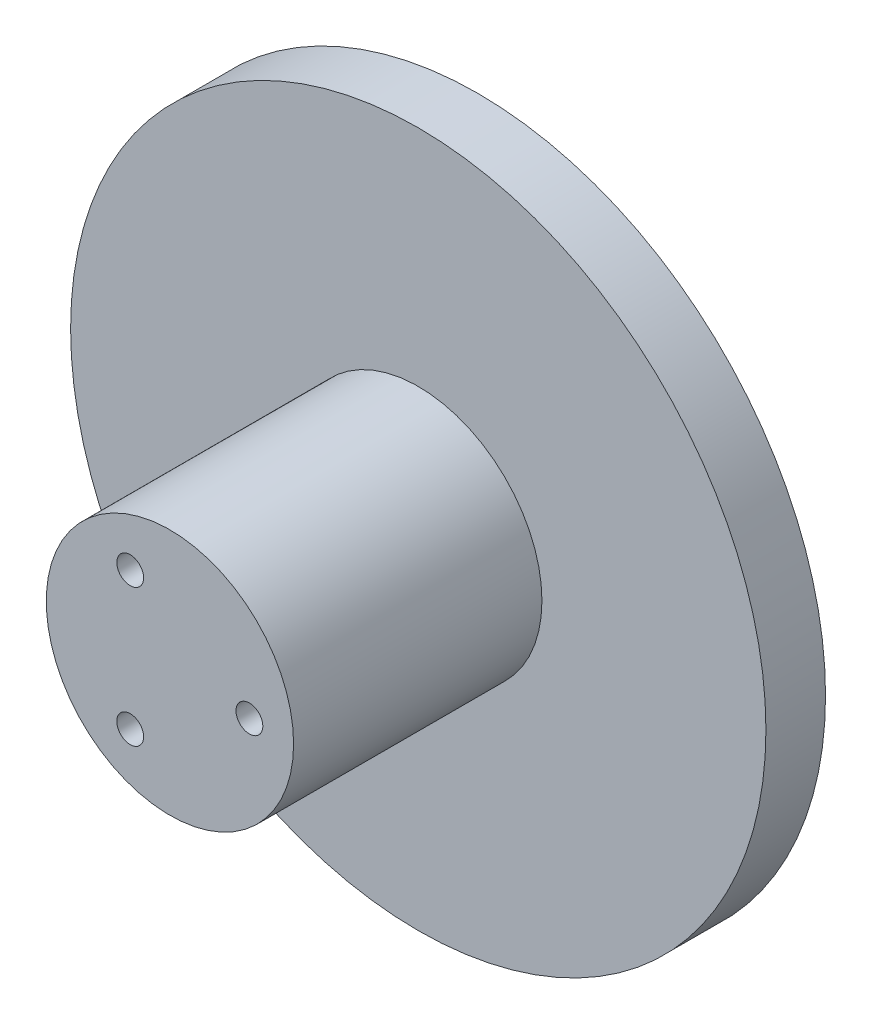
ISO-10303-21;
HEADER;
FILE_DESCRIPTION(('STEP AP214'),'2;1');
FILE_NAME('part.step','',(''),(''),'','','');
FILE_SCHEMA(('AUTOMOTIVE_DESIGN { 1 0 10303 214 1 1 1 1 }'));
ENDSEC;
DATA;
#1=APPLICATION_CONTEXT('core data for automotive mechanical design processes');
#2=APPLICATION_PROTOCOL_DEFINITION('international standard','automotive_design',2000,#1);
#3=PRODUCT_CONTEXT('',#1,'mechanical');
#4=PRODUCT('Part','Part','',(#3));
#5=PRODUCT_RELATED_PRODUCT_CATEGORY('part','',(#4));
#6=PRODUCT_DEFINITION_FORMATION('','',#4);
#7=PRODUCT_DEFINITION_CONTEXT('part definition',#1,'design');
#8=PRODUCT_DEFINITION('design','',#6,#7);
#9=PRODUCT_DEFINITION_SHAPE('','',#8);
#10=(LENGTH_UNIT() NAMED_UNIT(*) SI_UNIT(.MILLI.,.METRE.));
#11=(NAMED_UNIT(*) PLANE_ANGLE_UNIT() SI_UNIT($,.RADIAN.));
#12=(NAMED_UNIT(*) SI_UNIT($,.STERADIAN.) SOLID_ANGLE_UNIT());
#13=UNCERTAINTY_MEASURE_WITH_UNIT(LENGTH_MEASURE(1.E-05),#10,'distance_accuracy_value','');
#14=(GEOMETRIC_REPRESENTATION_CONTEXT(3) GLOBAL_UNCERTAINTY_ASSIGNED_CONTEXT((#13)) GLOBAL_UNIT_ASSIGNED_CONTEXT((#10,
#11,#12)) REPRESENTATION_CONTEXT('',''));
#15=CARTESIAN_POINT('',(0.,0.,0.));
#16=DIRECTION('',(0.,0.,1.));
#17=DIRECTION('',(1.,0.,0.));
#18=AXIS2_PLACEMENT_3D('',#15,#16,#17);
#19=CARTESIAN_POINT('',(8.,0.,23.));
#20=DIRECTION('',(0.,0.,1.));
#21=DIRECTION('',(1.,0.,0.));
#22=AXIS2_PLACEMENT_3D('',#19,#20,#21);
#23=PLANE('',#22);
#24=CARTESIAN_POINT('',(8.,0.,23.));
#25=DIRECTION('',(0.,0.,1.));
#26=DIRECTION('',(1.,0.,0.));
#27=AXIS2_PLACEMENT_3D('',#24,#25,#26);
#28=CIRCLE('',#27,1.35);
#29=CARTESIAN_POINT('',(9.35,0.,23.));
#30=VERTEX_POINT('',#29);
#31=EDGE_CURVE('E9',#30,#30,#28,.T.);
#32=ORIENTED_EDGE('',*,*,#31,.T.);
#33=EDGE_LOOP('',(#32));
#34=FACE_BOUND('',#33,.T.);
#35=ADVANCED_FACE('F14',(#34),#23,.T.);
#36=CARTESIAN_POINT('',(8.,0.,23.));
#37=DIRECTION('',(0.,0.,1.));
#38=DIRECTION('',(1.,0.,0.));
#39=AXIS2_PLACEMENT_3D('',#36,#37,#38);
#40=PLANE('',#39);
#41=CARTESIAN_POINT('',(-4.,6.928203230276,23.));
#42=DIRECTION('',(0.,0.,1.));
#43=DIRECTION('',(1.,0.,0.));
#44=AXIS2_PLACEMENT_3D('',#41,#42,#43);
#45=CIRCLE('',#44,1.35);
#46=CARTESIAN_POINT('',(-2.65,6.928203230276,23.));
#47=VERTEX_POINT('',#46);
#48=EDGE_CURVE('E21',#47,#47,#45,.T.);
#49=ORIENTED_EDGE('',*,*,#48,.T.);
#50=EDGE_LOOP('',(#49));
#51=FACE_BOUND('',#50,.T.);
#52=ADVANCED_FACE('F128',(#51),#40,.T.);
#53=CARTESIAN_POINT('',(8.,0.,23.));
#54=DIRECTION('',(0.,0.,1.));
#55=DIRECTION('',(1.,0.,0.));
#56=AXIS2_PLACEMENT_3D('',#53,#54,#55);
#57=PLANE('',#56);
#58=CARTESIAN_POINT('',(-4.,-6.928203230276,23.));
#59=DIRECTION('',(0.,0.,1.));
#60=DIRECTION('',(1.,0.,0.));
#61=AXIS2_PLACEMENT_3D('',#58,#59,#60);
#62=CIRCLE('',#61,1.35);
#63=CARTESIAN_POINT('',(-2.65,-6.928203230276,23.));
#64=VERTEX_POINT('',#63);
#65=EDGE_CURVE('E26',#64,#64,#62,.T.);
#66=ORIENTED_EDGE('',*,*,#65,.T.);
#67=EDGE_LOOP('',(#66));
#68=FACE_BOUND('',#67,.T.);
#69=ADVANCED_FACE('F135',(#68),#57,.T.);
#70=CARTESIAN_POINT('',(8.,0.,23.));
#71=DIRECTION('',(0.,0.,-1.));
#72=DIRECTION('',(1.,0.,0.));
#73=AXIS2_PLACEMENT_3D('',#70,#71,#72);
#74=CYLINDRICAL_SURFACE('',#73,1.35);
#75=CARTESIAN_POINT('',(8.,0.,31.));
#76=DIRECTION('',(0.,0.,1.));
#77=DIRECTION('',(1.,0.,0.));
#78=AXIS2_PLACEMENT_3D('',#75,#76,#77);
#79=CIRCLE('',#78,1.35);
#80=CARTESIAN_POINT('',(9.35,0.,31.));
#81=VERTEX_POINT('',#80);
#82=EDGE_CURVE('E34',#81,#81,#79,.T.);
#83=ORIENTED_EDGE('',*,*,#82,.T.);
#84=EDGE_LOOP('',(#83));
#85=FACE_BOUND('',#84,.T.);
#86=ORIENTED_EDGE('',*,*,#31,.F.);
#87=EDGE_LOOP('',(#86));
#88=FACE_BOUND('',#87,.T.);
#89=ADVANCED_FACE('F137',(#85,#88),#74,.F.);
#90=CARTESIAN_POINT('',(-4.,6.928203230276,23.));
#91=DIRECTION('',(0.,0.,-1.));
#92=DIRECTION('',(1.,0.,0.));
#93=AXIS2_PLACEMENT_3D('',#90,#91,#92);
#94=CYLINDRICAL_SURFACE('',#93,1.35);
#95=CARTESIAN_POINT('',(-4.,6.928203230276,31.));
#96=DIRECTION('',(0.,0.,1.));
#97=DIRECTION('',(1.,0.,0.));
#98=AXIS2_PLACEMENT_3D('',#95,#96,#97);
#99=CIRCLE('',#98,1.35);
#100=CARTESIAN_POINT('',(-2.65,6.928203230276,31.));
#101=VERTEX_POINT('',#100);
#102=EDGE_CURVE('E41',#101,#101,#99,.T.);
#103=ORIENTED_EDGE('',*,*,#102,.T.);
#104=EDGE_LOOP('',(#103));
#105=FACE_BOUND('',#104,.T.);
#106=ORIENTED_EDGE('',*,*,#48,.F.);
#107=EDGE_LOOP('',(#106));
#108=FACE_BOUND('',#107,.T.);
#109=ADVANCED_FACE('F171',(#105,#108),#94,.F.);
#110=CARTESIAN_POINT('',(-4.,-6.928203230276,23.));
#111=DIRECTION('',(0.,0.,-1.));
#112=DIRECTION('',(1.,0.,0.));
#113=AXIS2_PLACEMENT_3D('',#110,#111,#112);
#114=CYLINDRICAL_SURFACE('',#113,1.35);
#115=CARTESIAN_POINT('',(-4.,-6.928203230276,31.));
#116=DIRECTION('',(0.,0.,1.));
#117=DIRECTION('',(1.,0.,0.));
#118=AXIS2_PLACEMENT_3D('',#115,#116,#117);
#119=CIRCLE('',#118,1.35);
#120=CARTESIAN_POINT('',(-2.65,-6.928203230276,31.));
#121=VERTEX_POINT('',#120);
#122=EDGE_CURVE('E44',#121,#121,#119,.T.);
#123=ORIENTED_EDGE('',*,*,#122,.T.);
#124=EDGE_LOOP('',(#123));
#125=FACE_BOUND('',#124,.T.);
#126=ORIENTED_EDGE('',*,*,#65,.F.);
#127=EDGE_LOOP('',(#126));
#128=FACE_BOUND('',#127,.T.);
#129=ADVANCED_FACE('F169',(#125,#128),#114,.F.);
#130=CARTESIAN_POINT('',(0.,0.,31.));
#131=DIRECTION('',(0.,0.,1.));
#132=DIRECTION('',(1.,0.,0.));
#133=AXIS2_PLACEMENT_3D('',#130,#131,#132);
#134=PLANE('',#133);
#135=ORIENTED_EDGE('',*,*,#82,.F.);
#136=EDGE_LOOP('',(#135));
#137=FACE_BOUND('',#136,.T.);
#138=ORIENTED_EDGE('',*,*,#102,.F.);
#139=EDGE_LOOP('',(#138));
#140=FACE_BOUND('',#139,.T.);
#141=ORIENTED_EDGE('',*,*,#122,.F.);
#142=EDGE_LOOP('',(#141));
#143=FACE_BOUND('',#142,.T.);
#144=CARTESIAN_POINT('',(0.,0.,31.));
#145=DIRECTION('',(0.,0.,1.));
#146=DIRECTION('',(1.,0.,0.));
#147=AXIS2_PLACEMENT_3D('',#144,#145,#146);
#148=CIRCLE('',#147,12.45);
#149=CARTESIAN_POINT('',(12.45,0.,31.));
#150=VERTEX_POINT('',#149);
#151=EDGE_CURVE('E47',#150,#150,#148,.T.);
#152=ORIENTED_EDGE('',*,*,#151,.T.);
#153=EDGE_LOOP('',(#152));
#154=FACE_BOUND('',#153,.T.);
#155=ADVANCED_FACE('F168',(#137,#140,#143,#154),#134,.T.);
#156=CARTESIAN_POINT('',(27.,0.,5.));
#157=DIRECTION('',(0.,0.,1.));
#158=DIRECTION('',(1.,0.,0.));
#159=AXIS2_PLACEMENT_3D('',#156,#157,#158);
#160=PLANE('',#159);
#161=CARTESIAN_POINT('',(8.343458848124,25.678525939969,5.));
#162=DIRECTION('',(0.,0.,1.));
#163=DIRECTION('',(1.,0.,0.));
#164=AXIS2_PLACEMENT_3D('',#161,#162,#163);
#165=CIRCLE('',#164,2.575);
#166=CARTESIAN_POINT('',(10.918458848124,25.678525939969,5.));
#167=VERTEX_POINT('',#166);
#168=EDGE_CURVE('E49',#167,#167,#165,.T.);
#169=ORIENTED_EDGE('',*,*,#168,.F.);
#170=EDGE_LOOP('',(#169));
#171=FACE_BOUND('',#170,.T.);
#172=ADVANCED_FACE('F187',(#171),#160,.F.);
#173=CARTESIAN_POINT('',(27.,0.,5.));
#174=DIRECTION('',(0.,0.,1.));
#175=DIRECTION('',(1.,0.,0.));
#176=AXIS2_PLACEMENT_3D('',#173,#174,#175);
#177=PLANE('',#176);
#178=CARTESIAN_POINT('',(27.,0.,5.));
#179=DIRECTION('',(0.,0.,1.));
#180=DIRECTION('',(1.,0.,0.));
#181=AXIS2_PLACEMENT_3D('',#178,#179,#180);
#182=CIRCLE('',#181,2.575);
#183=CARTESIAN_POINT('',(29.575,0.,5.));
#184=VERTEX_POINT('',#183);
#185=EDGE_CURVE('E53',#184,#184,#182,.T.);
#186=ORIENTED_EDGE('',*,*,#185,.F.);
#187=EDGE_LOOP('',(#186));
#188=FACE_BOUND('',#187,.T.);
#189=ADVANCED_FACE('F186',(#188),#177,.F.);
#190=CARTESIAN_POINT('',(27.,0.,5.));
#191=DIRECTION('',(0.,0.,1.));
#192=DIRECTION('',(1.,0.,0.));
#193=AXIS2_PLACEMENT_3D('',#190,#191,#192);
#194=PLANE('',#193);
#195=CARTESIAN_POINT('',(-21.84345884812,15.870201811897,5.));
#196=DIRECTION('',(0.,0.,1.));
#197=DIRECTION('',(1.,0.,0.));
#198=AXIS2_PLACEMENT_3D('',#195,#196,#197);
#199=CIRCLE('',#198,2.575);
#200=CARTESIAN_POINT('',(-19.26845884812,15.870201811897,5.));
#201=VERTEX_POINT('',#200);
#202=EDGE_CURVE('E59',#201,#201,#199,.T.);
#203=ORIENTED_EDGE('',*,*,#202,.F.);
#204=EDGE_LOOP('',(#203));
#205=FACE_BOUND('',#204,.T.);
#206=ADVANCED_FACE('F163',(#205),#194,.F.);
#207=CARTESIAN_POINT('',(27.,0.,5.));
#208=DIRECTION('',(0.,0.,1.));
#209=DIRECTION('',(1.,0.,0.));
#210=AXIS2_PLACEMENT_3D('',#207,#208,#209);
#211=PLANE('',#210);
#212=CARTESIAN_POINT('',(8.343458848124,-25.67852593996,5.));
#213=DIRECTION('',(0.,0.,1.));
#214=DIRECTION('',(1.,0.,0.));
#215=AXIS2_PLACEMENT_3D('',#212,#213,#214);
#216=CIRCLE('',#215,2.575);
#217=CARTESIAN_POINT('',(10.918458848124,-25.67852593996,5.));
#218=VERTEX_POINT('',#217);
#219=EDGE_CURVE('E62',#218,#218,#216,.T.);
#220=ORIENTED_EDGE('',*,*,#219,.F.);
#221=EDGE_LOOP('',(#220));
#222=FACE_BOUND('',#221,.T.);
#223=ADVANCED_FACE('F156',(#222),#211,.F.);
#224=CARTESIAN_POINT('',(27.,0.,5.));
#225=DIRECTION('',(0.,0.,1.));
#226=DIRECTION('',(1.,0.,0.));
#227=AXIS2_PLACEMENT_3D('',#224,#225,#226);
#228=PLANE('',#227);
#229=CARTESIAN_POINT('',(-21.84345884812,-15.87020181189,5.));
#230=DIRECTION('',(0.,0.,1.));
#231=DIRECTION('',(1.,0.,0.));
#232=AXIS2_PLACEMENT_3D('',#229,#230,#231);
#233=CIRCLE('',#232,2.575);
#234=CARTESIAN_POINT('',(-19.26845884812,-15.87020181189,5.));
#235=VERTEX_POINT('',#234);
#236=EDGE_CURVE('E66',#235,#235,#233,.T.);
#237=ORIENTED_EDGE('',*,*,#236,.F.);
#238=EDGE_LOOP('',(#237));
#239=FACE_BOUND('',#238,.T.);
#240=ADVANCED_FACE('F153',(#239),#228,.F.);
#241=CARTESIAN_POINT('',(0.,0.,6.));
#242=DIRECTION('',(0.,0.,-1.));
#243=DIRECTION('',(1.,0.,0.));
#244=AXIS2_PLACEMENT_3D('',#241,#242,#243);
#245=CYLINDRICAL_SURFACE('',#244,12.45);
#246=ORIENTED_EDGE('',*,*,#151,.F.);
#247=EDGE_LOOP('',(#246));
#248=FACE_BOUND('',#247,.T.);
#249=CARTESIAN_POINT('',(0.,0.,6.));
#250=DIRECTION('',(0.,0.,1.));
#251=DIRECTION('',(1.,0.,0.));
#252=AXIS2_PLACEMENT_3D('',#249,#250,#251);
#253=CIRCLE('',#252,12.45);
#254=CARTESIAN_POINT('',(12.45,0.,6.));
#255=VERTEX_POINT('',#254);
#256=EDGE_CURVE('E69',#255,#255,#253,.T.);
#257=ORIENTED_EDGE('',*,*,#256,.T.);
#258=EDGE_LOOP('',(#257));
#259=FACE_BOUND('',#258,.T.);
#260=ADVANCED_FACE('F154',(#248,#259),#245,.T.);
#261=CARTESIAN_POINT('',(8.343458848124,25.678525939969,0.));
#262=DIRECTION('',(0.,0.,-1.));
#263=DIRECTION('',(1.,0.,0.));
#264=AXIS2_PLACEMENT_3D('',#261,#262,#263);
#265=CYLINDRICAL_SURFACE('',#264,2.575);
#266=ORIENTED_EDGE('',*,*,#168,.T.);
#267=EDGE_LOOP('',(#266));
#268=FACE_BOUND('',#267,.T.);
#269=CARTESIAN_POINT('',(8.343458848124,25.678525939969,0.));
#270=DIRECTION('',(0.,0.,1.));
#271=DIRECTION('',(1.,0.,0.));
#272=AXIS2_PLACEMENT_3D('',#269,#270,#271);
#273=CIRCLE('',#272,2.575);
#274=CARTESIAN_POINT('',(10.918458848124,25.678525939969,0.));
#275=VERTEX_POINT('',#274);
#276=EDGE_CURVE('E72',#275,#275,#273,.T.);
#277=ORIENTED_EDGE('',*,*,#276,.F.);
#278=EDGE_LOOP('',(#277));
#279=FACE_BOUND('',#278,.T.);
#280=ADVANCED_FACE('F161',(#268,#279),#265,.F.);
#281=CARTESIAN_POINT('',(27.,0.,0.));
#282=DIRECTION('',(0.,0.,-1.));
#283=DIRECTION('',(1.,0.,0.));
#284=AXIS2_PLACEMENT_3D('',#281,#282,#283);
#285=CYLINDRICAL_SURFACE('',#284,2.575);
#286=ORIENTED_EDGE('',*,*,#185,.T.);
#287=EDGE_LOOP('',(#286));
#288=FACE_BOUND('',#287,.T.);
#289=CARTESIAN_POINT('',(27.,0.,0.));
#290=DIRECTION('',(0.,0.,1.));
#291=DIRECTION('',(1.,0.,0.));
#292=AXIS2_PLACEMENT_3D('',#289,#290,#291);
#293=CIRCLE('',#292,2.575);
#294=CARTESIAN_POINT('',(29.575,0.,0.));
#295=VERTEX_POINT('',#294);
#296=EDGE_CURVE('E77',#295,#295,#293,.T.);
#297=ORIENTED_EDGE('',*,*,#296,.F.);
#298=EDGE_LOOP('',(#297));
#299=FACE_BOUND('',#298,.T.);
#300=ADVANCED_FACE('F176',(#288,#299),#285,.F.);
#301=CARTESIAN_POINT('',(-21.84345884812,15.870201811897,0.));
#302=DIRECTION('',(0.,0.,-1.));
#303=DIRECTION('',(1.,0.,0.));
#304=AXIS2_PLACEMENT_3D('',#301,#302,#303);
#305=CYLINDRICAL_SURFACE('',#304,2.575);
#306=ORIENTED_EDGE('',*,*,#202,.T.);
#307=EDGE_LOOP('',(#306));
#308=FACE_BOUND('',#307,.T.);
#309=CARTESIAN_POINT('',(-21.84345884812,15.870201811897,0.));
#310=DIRECTION('',(0.,0.,1.));
#311=DIRECTION('',(1.,0.,0.));
#312=AXIS2_PLACEMENT_3D('',#309,#310,#311);
#313=CIRCLE('',#312,2.575);
#314=CARTESIAN_POINT('',(-19.26845884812,15.870201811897,0.));
#315=VERTEX_POINT('',#314);
#316=EDGE_CURVE('E85',#315,#315,#313,.T.);
#317=ORIENTED_EDGE('',*,*,#316,.F.);
#318=EDGE_LOOP('',(#317));
#319=FACE_BOUND('',#318,.T.);
#320=ADVANCED_FACE('F144',(#308,#319),#305,.F.);
#321=CARTESIAN_POINT('',(8.343458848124,-25.67852593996,0.));
#322=DIRECTION('',(0.,0.,-1.));
#323=DIRECTION('',(1.,0.,0.));
#324=AXIS2_PLACEMENT_3D('',#321,#322,#323);
#325=CYLINDRICAL_SURFACE('',#324,2.575);
#326=ORIENTED_EDGE('',*,*,#219,.T.);
#327=EDGE_LOOP('',(#326));
#328=FACE_BOUND('',#327,.T.);
#329=CARTESIAN_POINT('',(8.343458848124,-25.67852593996,0.));
#330=DIRECTION('',(0.,0.,1.));
#331=DIRECTION('',(1.,0.,0.));
#332=AXIS2_PLACEMENT_3D('',#329,#330,#331);
#333=CIRCLE('',#332,2.575);
#334=CARTESIAN_POINT('',(10.918458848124,-25.67852593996,0.));
#335=VERTEX_POINT('',#334);
#336=EDGE_CURVE('E88',#335,#335,#333,.T.);
#337=ORIENTED_EDGE('',*,*,#336,.F.);
#338=EDGE_LOOP('',(#337));
#339=FACE_BOUND('',#338,.T.);
#340=ADVANCED_FACE('F138',(#328,#339),#325,.F.);
#341=CARTESIAN_POINT('',(-21.84345884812,-15.87020181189,0.));
#342=DIRECTION('',(0.,0.,-1.));
#343=DIRECTION('',(1.,0.,0.));
#344=AXIS2_PLACEMENT_3D('',#341,#342,#343);
#345=CYLINDRICAL_SURFACE('',#344,2.575);
#346=ORIENTED_EDGE('',*,*,#236,.T.);
#347=EDGE_LOOP('',(#346));
#348=FACE_BOUND('',#347,.T.);
#349=CARTESIAN_POINT('',(-21.84345884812,-15.87020181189,0.));
#350=DIRECTION('',(0.,0.,1.));
#351=DIRECTION('',(1.,0.,0.));
#352=AXIS2_PLACEMENT_3D('',#349,#350,#351);
#353=CIRCLE('',#352,2.575);
#354=CARTESIAN_POINT('',(-19.26845884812,-15.87020181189,0.));
#355=VERTEX_POINT('',#354);
#356=EDGE_CURVE('E89',#355,#355,#353,.T.);
#357=ORIENTED_EDGE('',*,*,#356,.F.);
#358=EDGE_LOOP('',(#357));
#359=FACE_BOUND('',#358,.T.);
#360=ADVANCED_FACE('F121',(#348,#359),#345,.F.);
#361=CARTESIAN_POINT('',(0.,0.,6.));
#362=DIRECTION('',(0.,0.,1.));
#363=DIRECTION('',(1.,0.,0.));
#364=AXIS2_PLACEMENT_3D('',#361,#362,#363);
#365=PLANE('',#364);
#366=ORIENTED_EDGE('',*,*,#256,.F.);
#367=EDGE_LOOP('',(#366));
#368=FACE_BOUND('',#367,.T.);
#369=CARTESIAN_POINT('',(0.,0.,6.));
#370=DIRECTION('',(0.,0.,1.));
#371=DIRECTION('',(1.,0.,0.));
#372=AXIS2_PLACEMENT_3D('',#369,#370,#371);
#373=CIRCLE('',#372,35.);
#374=CARTESIAN_POINT('',(35.,0.,6.));
#375=VERTEX_POINT('',#374);
#376=EDGE_CURVE('E94',#375,#375,#373,.T.);
#377=ORIENTED_EDGE('',*,*,#376,.T.);
#378=EDGE_LOOP('',(#377));
#379=FACE_BOUND('',#378,.T.);
#380=ADVANCED_FACE('F112',(#368,#379),#365,.T.);
#381=CARTESIAN_POINT('',(0.,0.,0.));
#382=DIRECTION('',(0.,0.,1.));
#383=DIRECTION('',(1.,0.,0.));
#384=AXIS2_PLACEMENT_3D('',#381,#382,#383);
#385=PLANE('',#384);
#386=ORIENTED_EDGE('',*,*,#276,.T.);
#387=EDGE_LOOP('',(#386));
#388=FACE_BOUND('',#387,.T.);
#389=ORIENTED_EDGE('',*,*,#296,.T.);
#390=EDGE_LOOP('',(#389));
#391=FACE_BOUND('',#390,.T.);
#392=ORIENTED_EDGE('',*,*,#316,.T.);
#393=EDGE_LOOP('',(#392));
#394=FACE_BOUND('',#393,.T.);
#395=ORIENTED_EDGE('',*,*,#336,.T.);
#396=EDGE_LOOP('',(#395));
#397=FACE_BOUND('',#396,.T.);
#398=ORIENTED_EDGE('',*,*,#356,.T.);
#399=EDGE_LOOP('',(#398));
#400=FACE_BOUND('',#399,.T.);
#401=CARTESIAN_POINT('',(0.,0.,0.));
#402=DIRECTION('',(0.,0.,1.));
#403=DIRECTION('',(1.,0.,0.));
#404=AXIS2_PLACEMENT_3D('',#401,#402,#403);
#405=CIRCLE('',#404,35.);
#406=CARTESIAN_POINT('',(35.,0.,0.));
#407=VERTEX_POINT('',#406);
#408=EDGE_CURVE('E101',#407,#407,#405,.T.);
#409=ORIENTED_EDGE('',*,*,#408,.F.);
#410=EDGE_LOOP('',(#409));
#411=FACE_BOUND('',#410,.T.);
#412=ADVANCED_FACE('F108',(#388,#391,#394,#397,#400,#411),#385,.F.);
#413=CARTESIAN_POINT('',(0.,0.,0.));
#414=DIRECTION('',(0.,0.,-1.));
#415=DIRECTION('',(1.,0.,0.));
#416=AXIS2_PLACEMENT_3D('',#413,#414,#415);
#417=CYLINDRICAL_SURFACE('',#416,35.);
#418=ORIENTED_EDGE('',*,*,#376,.F.);
#419=EDGE_LOOP('',(#418));
#420=FACE_BOUND('',#419,.T.);
#421=ORIENTED_EDGE('',*,*,#408,.T.);
#422=EDGE_LOOP('',(#421));
#423=FACE_BOUND('',#422,.T.);
#424=ADVANCED_FACE('F110',(#420,#423),#417,.T.);
#425=CLOSED_SHELL('',(#35,#52,#69,#89,#109,#129,#155,#172,#189,#206,#223,#240,#260,#280,#300,
#320,#340,#360,#380,#412,#424));
#426=MANIFOLD_SOLID_BREP('B1',#425);
#427=ADVANCED_BREP_SHAPE_REPRESENTATION('',(#18,#426),#14);
#428=SHAPE_DEFINITION_REPRESENTATION(#9,#427);
ENDSEC;
END-ISO-10303-21;
